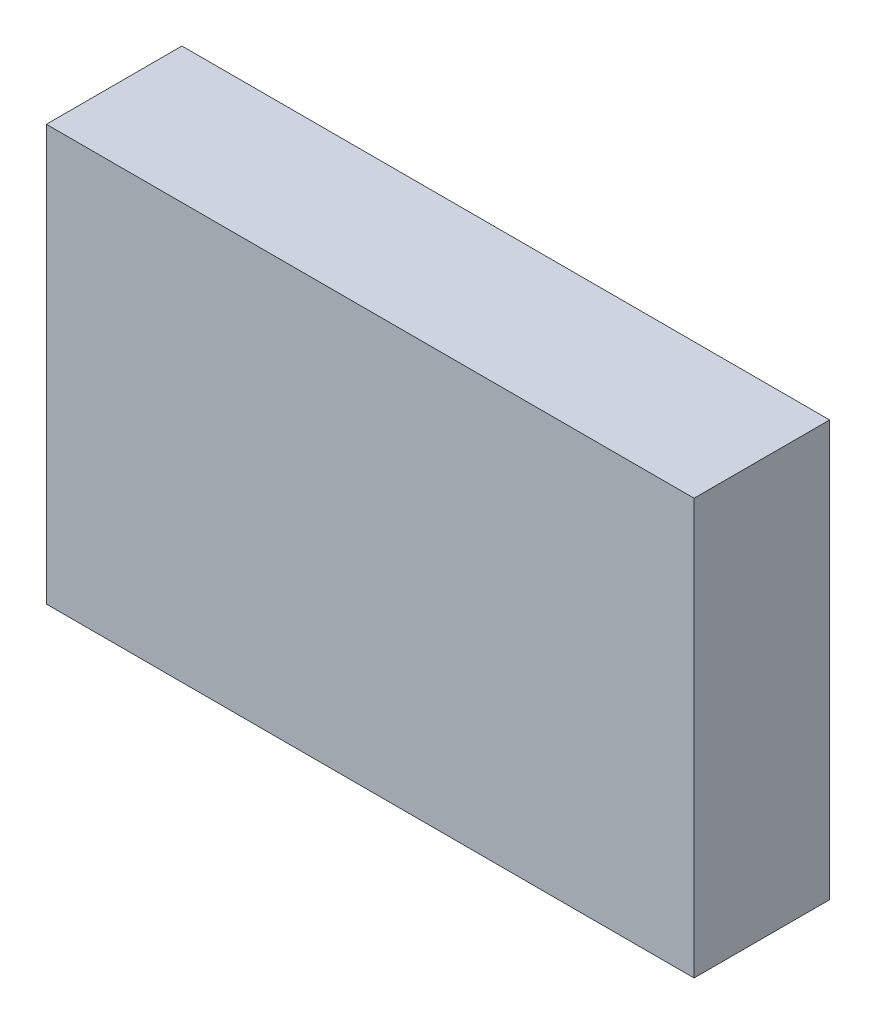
ISO-10303-21;
HEADER;
FILE_DESCRIPTION(('STEP AP214'),'2;1');
FILE_NAME('part.step','',(''),(''),'','','');
FILE_SCHEMA(('AUTOMOTIVE_DESIGN { 1 0 10303 214 1 1 1 1 }'));
ENDSEC;
DATA;
#1=APPLICATION_CONTEXT('core data for automotive mechanical design processes');
#2=APPLICATION_PROTOCOL_DEFINITION('international standard','automotive_design',2000,#1);
#3=PRODUCT_CONTEXT('',#1,'mechanical');
#4=PRODUCT('Part','Part','',(#3));
#5=PRODUCT_RELATED_PRODUCT_CATEGORY('part','',(#4));
#6=PRODUCT_DEFINITION_FORMATION('','',#4);
#7=PRODUCT_DEFINITION_CONTEXT('part definition',#1,'design');
#8=PRODUCT_DEFINITION('design','',#6,#7);
#9=PRODUCT_DEFINITION_SHAPE('','',#8);
#10=(LENGTH_UNIT() NAMED_UNIT(*) SI_UNIT(.MILLI.,.METRE.));
#11=(NAMED_UNIT(*) PLANE_ANGLE_UNIT() SI_UNIT($,.RADIAN.));
#12=(NAMED_UNIT(*) SI_UNIT($,.STERADIAN.) SOLID_ANGLE_UNIT());
#13=UNCERTAINTY_MEASURE_WITH_UNIT(LENGTH_MEASURE(1.E-05),#10,'distance_accuracy_value','');
#14=(GEOMETRIC_REPRESENTATION_CONTEXT(3) GLOBAL_UNCERTAINTY_ASSIGNED_CONTEXT((#13)) GLOBAL_UNIT_ASSIGNED_CONTEXT((#10,
#11,#12)) REPRESENTATION_CONTEXT('',''));
#15=CARTESIAN_POINT('',(0.,0.,0.));
#16=DIRECTION('',(0.,0.,1.));
#17=DIRECTION('',(1.,0.,0.));
#18=AXIS2_PLACEMENT_3D('',#15,#16,#17);
#19=CARTESIAN_POINT('',(-485.394,311.3905,101.6));
#20=DIRECTION('',(0.,-1.,0.));
#21=DIRECTION('',(1.,0.,0.));
#22=AXIS2_PLACEMENT_3D('',#19,#20,#21);
#23=PLANE('',#22);
#24=DIRECTION('',(-1.,0.,0.));
#25=VECTOR('',#24,1.);
#26=CARTESIAN_POINT('',(-485.394,311.3905,-101.6));
#27=LINE('',#26,#25);
#28=CARTESIAN_POINT('',(485.394,311.3905,-101.6));
#29=VERTEX_POINT('',#28);
#30=CARTESIAN_POINT('',(-485.394,311.3905,-101.6));
#31=VERTEX_POINT('',#30);
#32=EDGE_CURVE('E114',#29,#31,#27,.T.);
#33=ORIENTED_EDGE('',*,*,#32,.T.);
#34=DIRECTION('',(0.,0.,-1.));
#35=VECTOR('',#34,1.);
#36=CARTESIAN_POINT('',(-485.394,311.3905,101.6));
#37=LINE('',#36,#35);
#38=CARTESIAN_POINT('',(-485.394,311.3905,101.6));
#39=VERTEX_POINT('',#38);
#40=EDGE_CURVE('E11',#39,#31,#37,.T.);
#41=ORIENTED_EDGE('',*,*,#40,.F.);
#42=DIRECTION('',(-1.,0.,0.));
#43=VECTOR('',#42,1.);
#44=CARTESIAN_POINT('',(-485.394,311.3905,101.6));
#45=LINE('',#44,#43);
#46=CARTESIAN_POINT('',(485.394,311.3905,101.6));
#47=VERTEX_POINT('',#46);
#48=EDGE_CURVE('E100',#47,#39,#45,.T.);
#49=ORIENTED_EDGE('',*,*,#48,.F.);
#50=DIRECTION('',(0.,0.,-1.));
#51=VECTOR('',#50,1.);
#52=CARTESIAN_POINT('',(485.394,311.3905,101.6));
#53=LINE('',#52,#51);
#54=EDGE_CURVE('E108',#47,#29,#53,.T.);
#55=ORIENTED_EDGE('',*,*,#54,.T.);
#56=EDGE_LOOP('',(#33,#41,#49,#55));
#57=FACE_BOUND('',#56,.T.);
#58=ADVANCED_FACE('F44',(#57),#23,.F.);
#59=CARTESIAN_POINT('',(-485.394,-311.3905,101.6));
#60=DIRECTION('',(1.,0.,0.));
#61=DIRECTION('',(0.,0.,-1.));
#62=AXIS2_PLACEMENT_3D('',#59,#60,#61);
#63=PLANE('',#62);
#64=DIRECTION('',(0.,-1.,0.));
#65=VECTOR('',#64,1.);
#66=CARTESIAN_POINT('',(-485.394,-311.3905,-101.6));
#67=LINE('',#66,#65);
#68=CARTESIAN_POINT('',(-485.394,-311.3905,-101.6));
#69=VERTEX_POINT('',#68);
#70=EDGE_CURVE('E105',#31,#69,#67,.T.);
#71=ORIENTED_EDGE('',*,*,#70,.T.);
#72=DIRECTION('',(0.,0.,-1.));
#73=VECTOR('',#72,1.);
#74=CARTESIAN_POINT('',(-485.394,-311.3905,101.6));
#75=LINE('',#74,#73);
#76=CARTESIAN_POINT('',(-485.394,-311.3905,101.6));
#77=VERTEX_POINT('',#76);
#78=EDGE_CURVE('E53',#77,#69,#75,.T.);
#79=ORIENTED_EDGE('',*,*,#78,.F.);
#80=DIRECTION('',(0.,-1.,0.));
#81=VECTOR('',#80,1.);
#82=CARTESIAN_POINT('',(-485.394,-311.3905,101.6));
#83=LINE('',#82,#81);
#84=EDGE_CURVE('E95',#39,#77,#83,.T.);
#85=ORIENTED_EDGE('',*,*,#84,.F.);
#86=ORIENTED_EDGE('',*,*,#40,.T.);
#87=EDGE_LOOP('',(#71,#79,#85,#86));
#88=FACE_BOUND('',#87,.T.);
#89=ADVANCED_FACE('F101',(#88),#63,.F.);
#90=CARTESIAN_POINT('',(-485.394,-311.3905,101.6));
#91=DIRECTION('',(0.,1.,0.));
#92=DIRECTION('',(-1.,0.,0.));
#93=AXIS2_PLACEMENT_3D('',#90,#91,#92);
#94=PLANE('',#93);
#95=DIRECTION('',(1.,0.,0.));
#96=VECTOR('',#95,1.);
#97=CARTESIAN_POINT('',(-485.394,-311.3905,-101.6));
#98=LINE('',#97,#96);
#99=CARTESIAN_POINT('',(485.394,-311.3905,-101.6));
#100=VERTEX_POINT('',#99);
#101=EDGE_CURVE('E76',#69,#100,#98,.T.);
#102=ORIENTED_EDGE('',*,*,#101,.T.);
#103=DIRECTION('',(0.,0.,-1.));
#104=VECTOR('',#103,1.);
#105=CARTESIAN_POINT('',(485.394,-311.3905,101.6));
#106=LINE('',#105,#104);
#107=CARTESIAN_POINT('',(485.394,-311.3905,101.6));
#108=VERTEX_POINT('',#107);
#109=EDGE_CURVE('E102',#108,#100,#106,.T.);
#110=ORIENTED_EDGE('',*,*,#109,.F.);
#111=DIRECTION('',(1.,0.,0.));
#112=VECTOR('',#111,1.);
#113=CARTESIAN_POINT('',(-485.394,-311.3905,101.6));
#114=LINE('',#113,#112);
#115=EDGE_CURVE('E92',#77,#108,#114,.T.);
#116=ORIENTED_EDGE('',*,*,#115,.F.);
#117=ORIENTED_EDGE('',*,*,#78,.T.);
#118=EDGE_LOOP('',(#102,#110,#116,#117));
#119=FACE_BOUND('',#118,.T.);
#120=ADVANCED_FACE('F104',(#119),#94,.F.);
#121=CARTESIAN_POINT('',(485.394,-311.3905,101.6));
#122=DIRECTION('',(-1.,0.,0.));
#123=DIRECTION('',(0.,0.,1.));
#124=AXIS2_PLACEMENT_3D('',#121,#122,#123);
#125=PLANE('',#124);
#126=DIRECTION('',(0.,1.,0.));
#127=VECTOR('',#126,1.);
#128=CARTESIAN_POINT('',(485.394,-311.3905,-101.6));
#129=LINE('',#128,#127);
#130=EDGE_CURVE('E82',#100,#29,#129,.T.);
#131=ORIENTED_EDGE('',*,*,#130,.T.);
#132=ORIENTED_EDGE('',*,*,#54,.F.);
#133=DIRECTION('',(0.,1.,0.));
#134=VECTOR('',#133,1.);
#135=CARTESIAN_POINT('',(485.394,-311.3905,101.6));
#136=LINE('',#135,#134);
#137=EDGE_CURVE('E65',#108,#47,#136,.T.);
#138=ORIENTED_EDGE('',*,*,#137,.F.);
#139=ORIENTED_EDGE('',*,*,#109,.T.);
#140=EDGE_LOOP('',(#131,#132,#138,#139));
#141=FACE_BOUND('',#140,.T.);
#142=ADVANCED_FACE('F127',(#141),#125,.F.);
#143=CARTESIAN_POINT('',(0.,0.,101.6));
#144=DIRECTION('',(0.,0.,1.));
#145=DIRECTION('',(1.,0.,0.));
#146=AXIS2_PLACEMENT_3D('',#143,#144,#145);
#147=PLANE('',#146);
#148=ORIENTED_EDGE('',*,*,#48,.T.);
#149=ORIENTED_EDGE('',*,*,#84,.T.);
#150=ORIENTED_EDGE('',*,*,#115,.T.);
#151=ORIENTED_EDGE('',*,*,#137,.T.);
#152=EDGE_LOOP('',(#148,#149,#150,#151));
#153=FACE_BOUND('',#152,.T.);
#154=ADVANCED_FACE('F91',(#153),#147,.T.);
#155=CARTESIAN_POINT('',(0.,0.,-101.6));
#156=DIRECTION('',(0.,0.,1.));
#157=DIRECTION('',(1.,0.,0.));
#158=AXIS2_PLACEMENT_3D('',#155,#156,#157);
#159=PLANE('',#158);
#160=ORIENTED_EDGE('',*,*,#32,.F.);
#161=ORIENTED_EDGE('',*,*,#130,.F.);
#162=ORIENTED_EDGE('',*,*,#101,.F.);
#163=ORIENTED_EDGE('',*,*,#70,.F.);
#164=EDGE_LOOP('',(#160,#161,#162,#163));
#165=FACE_BOUND('',#164,.T.);
#166=ADVANCED_FACE('F129',(#165),#159,.F.);
#167=CLOSED_SHELL('',(#58,#89,#120,#142,#154,#166));
#168=MANIFOLD_SOLID_BREP('B2',#167);
#169=ADVANCED_BREP_SHAPE_REPRESENTATION('',(#18,#168),#14);
#170=SHAPE_DEFINITION_REPRESENTATION(#9,#169);
ENDSEC;
END-ISO-10303-21;
